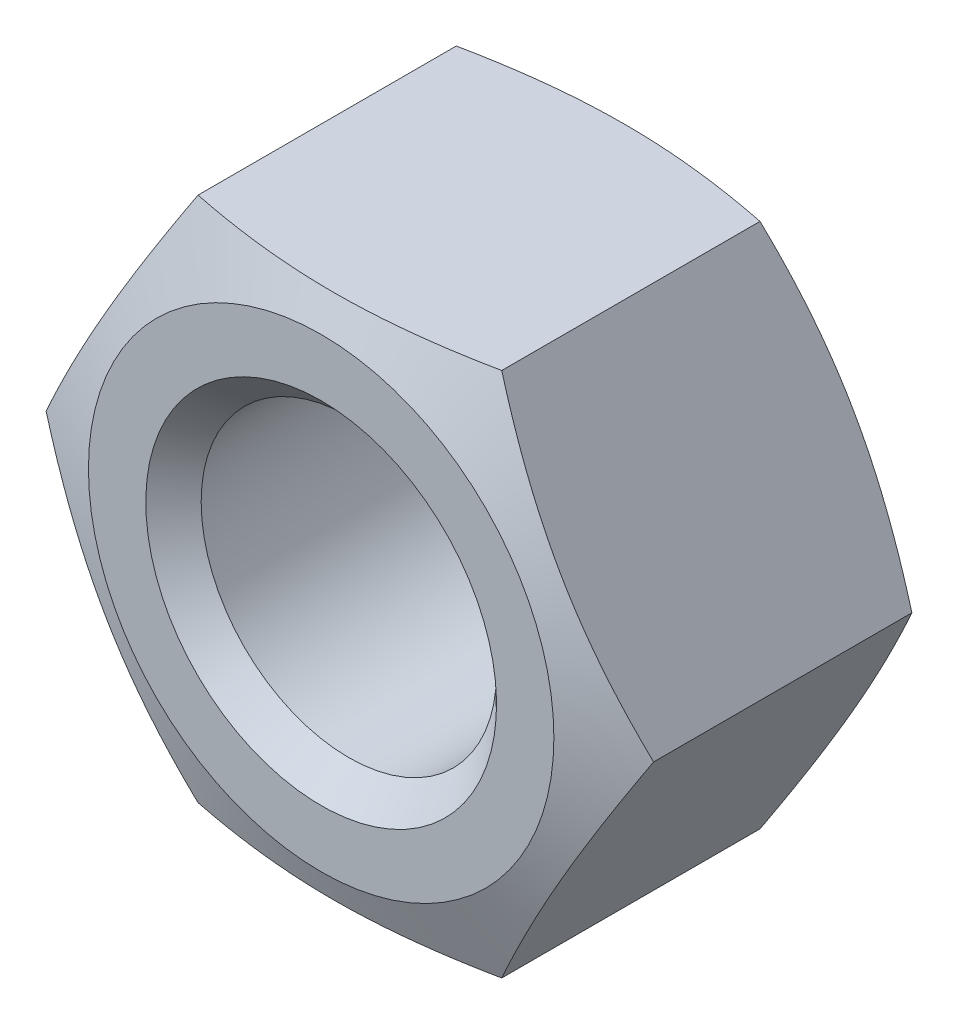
ISO-10303-21;
HEADER;
FILE_DESCRIPTION(('STEP AP214'),'2;1');
FILE_NAME('part.step','',(''),(''),'','','');
FILE_SCHEMA(('AUTOMOTIVE_DESIGN { 1 0 10303 214 1 1 1 1 }'));
ENDSEC;
DATA;
#1=APPLICATION_CONTEXT('core data for automotive mechanical design processes');
#2=APPLICATION_PROTOCOL_DEFINITION('international standard','automotive_design',2000,#1);
#3=PRODUCT_CONTEXT('',#1,'mechanical');
#4=PRODUCT('Part','Part','',(#3));
#5=PRODUCT_RELATED_PRODUCT_CATEGORY('part','',(#4));
#6=PRODUCT_DEFINITION_FORMATION('','',#4);
#7=PRODUCT_DEFINITION_CONTEXT('part definition',#1,'design');
#8=PRODUCT_DEFINITION('design','',#6,#7);
#9=PRODUCT_DEFINITION_SHAPE('','',#8);
#10=(LENGTH_UNIT() NAMED_UNIT(*) SI_UNIT(.MILLI.,.METRE.));
#11=(NAMED_UNIT(*) PLANE_ANGLE_UNIT() SI_UNIT($,.RADIAN.));
#12=(NAMED_UNIT(*) SI_UNIT($,.STERADIAN.) SOLID_ANGLE_UNIT());
#13=UNCERTAINTY_MEASURE_WITH_UNIT(LENGTH_MEASURE(1.E-05),#10,'distance_accuracy_value','');
#14=(GEOMETRIC_REPRESENTATION_CONTEXT(3) GLOBAL_UNCERTAINTY_ASSIGNED_CONTEXT((#13)) GLOBAL_UNIT_ASSIGNED_CONTEXT((#10,
#11,#12)) REPRESENTATION_CONTEXT('',''));
#15=CARTESIAN_POINT('',(0.,0.,0.));
#16=DIRECTION('',(0.,0.,1.));
#17=DIRECTION('',(1.,0.,0.));
#18=AXIS2_PLACEMENT_3D('',#15,#16,#17);
#19=CARTESIAN_POINT('',(10.3923,0.,10.8));
#20=DIRECTION('',(0.,0.,1.));
#21=DIRECTION('',(1.,0.,0.));
#22=AXIS2_PLACEMENT_3D('',#19,#20,#21);
#23=PLANE('',#22);
#24=CARTESIAN_POINT('',(0.,0.,10.8));
#25=DIRECTION('',(0.,0.,-1.));
#26=DIRECTION('',(0.,1.,0.));
#27=AXIS2_PLACEMENT_3D('',#24,#25,#26);
#28=CIRCLE('',#27,6.);
#29=CARTESIAN_POINT('',(0.,6.,10.8));
#30=VERTEX_POINT('',#29);
#31=EDGE_CURVE('E205',#30,#30,#28,.T.);
#32=ORIENTED_EDGE('',*,*,#31,.T.);
#33=EDGE_LOOP('',(#32));
#34=FACE_BOUND('',#33,.T.);
#35=CARTESIAN_POINT('',(0.,0.,10.8));
#36=DIRECTION('',(0.,0.,-1.));
#37=DIRECTION('',(0.,1.,0.));
#38=AXIS2_PLACEMENT_3D('',#35,#36,#37);
#39=CIRCLE('',#38,7.96221472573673);
#40=CARTESIAN_POINT('',(0.,7.96221472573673,10.8));
#41=VERTEX_POINT('',#40);
#42=EDGE_CURVE('E208',#41,#41,#39,.T.);
#43=ORIENTED_EDGE('',*,*,#42,.F.);
#44=EDGE_LOOP('',(#43));
#45=FACE_BOUND('',#44,.T.);
#46=ADVANCED_FACE('F14',(#34,#45),#23,.T.);
#47=CARTESIAN_POINT('',(0.,0.,10.8));
#48=DIRECTION('',(0.,0.,1.));
#49=DIRECTION('',(0.,-1.,0.));
#50=AXIS2_PLACEMENT_3D('',#47,#48,#49);
#51=CONICAL_SURFACE('',#50,6.,0.785398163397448);
#52=CARTESIAN_POINT('',(0.,0.,9.8528125));
#53=DIRECTION('',(0.,0.,-1.));
#54=DIRECTION('',(0.,1.,0.));
#55=AXIS2_PLACEMENT_3D('',#52,#53,#54);
#56=CIRCLE('',#55,5.0528125);
#57=CARTESIAN_POINT('',(0.,5.0528125,9.8528125));
#58=VERTEX_POINT('',#57);
#59=EDGE_CURVE('E95',#58,#58,#56,.T.);
#60=ORIENTED_EDGE('',*,*,#59,.T.);
#61=EDGE_LOOP('',(#60));
#62=FACE_BOUND('',#61,.T.);
#63=ORIENTED_EDGE('',*,*,#31,.F.);
#64=EDGE_LOOP('',(#63));
#65=FACE_BOUND('',#64,.T.);
#66=ADVANCED_FACE('F138',(#62,#65),#51,.F.);
#67=CARTESIAN_POINT('',(0.,0.,0.));
#68=DIRECTION('',(0.,0.,-1.));
#69=DIRECTION('',(0.,1.,0.));
#70=AXIS2_PLACEMENT_3D('',#67,#68,#69);
#71=CYLINDRICAL_SURFACE('',#70,5.0528125);
#72=CARTESIAN_POINT('',(0.,0.,0.9471875));
#73=DIRECTION('',(0.,0.,-1.));
#74=DIRECTION('',(0.,1.,0.));
#75=AXIS2_PLACEMENT_3D('',#72,#73,#74);
#76=CIRCLE('',#75,5.0528125);
#77=CARTESIAN_POINT('',(0.,5.0528125,0.9471875));
#78=VERTEX_POINT('',#77);
#79=EDGE_CURVE('E92',#78,#78,#76,.T.);
#80=ORIENTED_EDGE('',*,*,#79,.T.);
#81=EDGE_LOOP('',(#80));
#82=FACE_BOUND('',#81,.T.);
#83=ORIENTED_EDGE('',*,*,#59,.F.);
#84=EDGE_LOOP('',(#83));
#85=FACE_BOUND('',#84,.T.);
#86=ADVANCED_FACE('F200',(#82,#85),#71,.F.);
#87=CARTESIAN_POINT('',(0.,0.,0.));
#88=DIRECTION('',(0.,0.,-1.));
#89=DIRECTION('',(0.,1.,0.));
#90=AXIS2_PLACEMENT_3D('',#87,#88,#89);
#91=CONICAL_SURFACE('',#90,6.,0.785398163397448);
#92=ORIENTED_EDGE('',*,*,#79,.F.);
#93=EDGE_LOOP('',(#92));
#94=FACE_BOUND('',#93,.T.);
#95=CARTESIAN_POINT('',(0.,0.,0.));
#96=DIRECTION('',(0.,0.,-1.));
#97=DIRECTION('',(0.,1.,0.));
#98=AXIS2_PLACEMENT_3D('',#95,#96,#97);
#99=CIRCLE('',#98,6.);
#100=CARTESIAN_POINT('',(0.,6.,0.));
#101=VERTEX_POINT('',#100);
#102=EDGE_CURVE('E209',#101,#101,#99,.T.);
#103=ORIENTED_EDGE('',*,*,#102,.T.);
#104=EDGE_LOOP('',(#103));
#105=FACE_BOUND('',#104,.T.);
#106=ADVANCED_FACE('F136',(#94,#105),#91,.F.);
#107=CARTESIAN_POINT('',(0.,0.,9.81818181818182));
#108=DIRECTION('',(0.,0.,-1.));
#109=DIRECTION('',(0.,1.,0.));
#110=AXIS2_PLACEMENT_3D('',#107,#108,#109);
#111=CONICAL_SURFACE('',#110,10.3923,1.18682389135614);
#112=ORIENTED_EDGE('',*,*,#42,.T.);
#113=EDGE_LOOP('',(#112));
#114=FACE_BOUND('',#113,.T.);
#115=CARTESIAN_POINT('',(-13.7213175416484,-8.99999580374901,7.38704087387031));
#116=CARTESIAN_POINT('',(-13.3155095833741,-8.99999580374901,7.52409883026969));
#117=CARTESIAN_POINT('',(-12.9091608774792,-8.99999580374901,7.65958531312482));
#118=CARTESIAN_POINT('',(-12.0951022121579,-8.99999580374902,7.92653724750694));
#119=CARTESIAN_POINT('',(-11.6873921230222,-8.99999580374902,8.05800230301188));
#120=CARTESIAN_POINT('',(-10.8694196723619,-8.99999580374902,8.31631894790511));
#121=CARTESIAN_POINT('',(-10.4591535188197,-8.99999580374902,8.44315857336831));
#122=CARTESIAN_POINT('',(-9.63676583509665,-8.99999580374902,8.69066052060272));
#123=CARTESIAN_POINT('',(-9.22464435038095,-8.99999580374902,8.8113229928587));
#124=CARTESIAN_POINT('',(-8.40355167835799,-8.99999580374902,9.04340438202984));
#125=CARTESIAN_POINT('',(-7.9946087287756,-8.99999580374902,9.15492270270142));
#126=CARTESIAN_POINT('',(-7.17423324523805,-8.99999580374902,9.36851434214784));
#127=CARTESIAN_POINT('',(-6.76280063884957,-8.99999580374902,9.47058738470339));
#128=CARTESIAN_POINT('',(-5.93738971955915,-8.99999580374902,9.66284377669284));
#129=CARTESIAN_POINT('',(-5.52341298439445,-8.99999580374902,9.75303384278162));
#130=CARTESIAN_POINT('',(-4.69251804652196,-8.99999580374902,9.91873092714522));
#131=CARTESIAN_POINT('',(-4.27560005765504,-8.99999580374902,9.99423900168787));
#132=CARTESIAN_POINT('',(-3.52448503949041,-8.99999580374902,10.1137820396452));
#133=CARTESIAN_POINT('',(-3.19081245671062,-8.99999580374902,10.16109552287));
#134=CARTESIAN_POINT('',(-2.52188176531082,-8.99999580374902,10.2428488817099));
#135=CARTESIAN_POINT('',(-2.18662369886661,-8.99999580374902,10.2772890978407));
#136=CARTESIAN_POINT('',(-1.51515188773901,-8.99999580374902,10.3319321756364));
#137=CARTESIAN_POINT('',(-1.1789388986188,-8.99999580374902,10.3521442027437));
#138=CARTESIAN_POINT('',(-0.505939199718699,-8.99999580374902,10.3774838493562));
#139=CARTESIAN_POINT('',(-0.169152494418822,-8.99999580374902,10.3826115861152));
#140=CARTESIAN_POINT('',(0.505939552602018,-8.99999580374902,10.3775340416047));
#141=CARTESIAN_POINT('',(0.844244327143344,-8.99999580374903,10.3672541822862));
#142=CARTESIAN_POINT('',(1.5200587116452,-8.99999580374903,10.3316970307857));
#143=CARTESIAN_POINT('',(1.85756830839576,-8.99999580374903,10.3064194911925));
#144=CARTESIAN_POINT('',(2.5314533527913,-8.99999580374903,10.2419267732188));
#145=CARTESIAN_POINT('',(2.86782793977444,-8.99999580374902,10.2027027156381));
#146=CARTESIAN_POINT('',(3.53886726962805,-8.99999580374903,10.1117937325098));
#147=CARTESIAN_POINT('',(3.8735320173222,-8.99999580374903,10.0601088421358));
#148=CARTESIAN_POINT('',(4.59706326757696,-8.99999580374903,9.93631566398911));
#149=CARTESIAN_POINT('',(4.98559010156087,-8.99999580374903,9.8622350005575));
#150=CARTESIAN_POINT('',(5.76012811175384,-8.99999580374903,9.70183075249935));
#151=CARTESIAN_POINT('',(6.14613897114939,-8.99999580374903,9.61550565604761));
#152=CARTESIAN_POINT('',(6.91596603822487,-8.99999580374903,9.43283198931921));
#153=CARTESIAN_POINT('',(7.29978106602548,-8.99999580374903,9.33647848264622));
#154=CARTESIAN_POINT('',(8.06526157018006,-8.99999580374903,9.13568406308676));
#155=CARTESIAN_POINT('',(8.44692712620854,-8.99999580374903,9.03124345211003));
#156=CARTESIAN_POINT('',(9.20939547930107,-8.99999580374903,8.81552938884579));
#157=CARTESIAN_POINT('',(9.5901933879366,-8.99999580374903,8.70423873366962));
#158=CARTESIAN_POINT('',(10.3501827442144,-8.99999580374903,8.47631047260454));
#159=CARTESIAN_POINT('',(10.7293741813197,-8.99999580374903,8.35967283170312));
#160=CARTESIAN_POINT('',(11.4862787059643,-8.99999580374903,8.1220670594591));
#161=CARTESIAN_POINT('',(11.8639921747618,-8.99999580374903,8.00110013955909));
#162=CARTESIAN_POINT('',(12.618251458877,-8.99999580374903,7.75557437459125));
#163=CARTESIAN_POINT('',(12.9947972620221,-8.99999580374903,7.6310154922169));
#164=CARTESIAN_POINT('',(14.117808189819,-8.99999580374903,7.25463064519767));
#165=CARTESIAN_POINT('',(14.8628146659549,-8.99999580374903,6.99845398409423));
#166=CARTESIAN_POINT('',(16.3500116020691,-8.99999580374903,6.47792349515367));
#167=CARTESIAN_POINT('',(17.0922018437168,-8.99999580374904,6.21356904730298));
#168=CARTESIAN_POINT('',(18.5695432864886,-8.99999580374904,5.68069786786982));
#169=CARTESIAN_POINT('',(19.3047085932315,-8.99999580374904,5.41222018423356));
#170=CARTESIAN_POINT('',(20.4062006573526,-8.99999580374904,5.00624839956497));
#171=CARTESIAN_POINT('',(20.7731323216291,-8.99999580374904,4.87039057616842));
#172=CARTESIAN_POINT('',(21.5066380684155,-8.99999580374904,4.59771693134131));
#173=CARTESIAN_POINT('',(21.8732121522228,-8.99999580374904,4.46090111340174));
#174=CARTESIAN_POINT('',(22.2396315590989,-8.99999580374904,4.32367204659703));
#175=B_SPLINE_CURVE_WITH_KNOTS('',3,(#115,#116,#117,#118,#119,#120,#121,#122,#123,#124,#125,
#126,#127,#128,#129,#130,#131,#132,#133,#134,#135,#136,#137,#138,#139,#140,#141,#142,#143,#144,
#145,#146,#147,#148,#149,#150,#151,#152,#153,#154,#155,#156,#157,#158,#159,#160,#161,#162,#163,
#164,#165,#166,#167,#168,#169,#170,#171,#172,#173,#174),.UNSPECIFIED.,.F.,.F.,(4,2,2,2,2,2,2,2,
2,2,2,2,2,2,2,2,2,2,2,2,2,2,2,2,2,2,2,2,2,4),(0.,1.28499534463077,2.57011682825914,
3.85835550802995,5.14656278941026,6.41810144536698,7.6896772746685,8.96053125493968,
10.2312937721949,11.2421091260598,12.2528977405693,13.2630346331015,14.2731636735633,
15.288197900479,16.3032488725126,17.3189472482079,18.334642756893,19.5209748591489,
20.7074535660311,21.8945190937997,23.0815403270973,24.2716749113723,25.4618172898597,
26.6516292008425,27.8414534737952,30.2048363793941,32.568398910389,34.91634290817,
36.0901672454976,37.263987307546),.UNSPECIFIED.);
#176=CARTESIAN_POINT('',(-5.19615,-8.99999580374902,9.81818181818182));
#177=VERTEX_POINT('',#176);
#178=CARTESIAN_POINT('',(5.19615,-8.99999580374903,9.81818181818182));
#179=VERTEX_POINT('',#178);
#180=EDGE_CURVE('E75',#177,#179,#175,.T.);
#181=ORIENTED_EDGE('',*,*,#180,.T.);
#182=CARTESIAN_POINT('',(5.19614988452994,-8.99999600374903,9.81818177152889));
#183=CARTESIAN_POINT('',(5.37768933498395,-8.68556045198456,9.89153268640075));
#184=CARTESIAN_POINT('',(5.55982797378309,-8.37008707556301,9.9593574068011));
#185=CARTESIAN_POINT('',(5.92530962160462,-7.73705429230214,10.0818698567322));
#186=CARTESIAN_POINT('',(6.10865327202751,-7.41949377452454,10.136549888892));
#187=CARTESIAN_POINT('',(6.47628397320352,-6.78273872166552,10.2305837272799));
#188=CARTESIAN_POINT('',(6.66057072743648,-6.46354470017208,10.2699420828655));
#189=CARTESIAN_POINT('',(7.02982878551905,-5.82397098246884,10.3315086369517));
#190=CARTESIAN_POINT('',(7.21479992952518,-5.50359156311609,10.3537206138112));
#191=CARTESIAN_POINT('',(7.58192629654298,-4.86771004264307,10.3796131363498));
#192=CARTESIAN_POINT('',(7.76407600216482,-4.55221749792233,10.3836019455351));
#193=CARTESIAN_POINT('',(8.12826777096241,-3.92141885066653,10.3736718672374));
#194=CARTESIAN_POINT('',(8.31030982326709,-3.60611276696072,10.3597514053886));
#195=CARTESIAN_POINT('',(8.6737364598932,-2.97663936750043,10.3147511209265));
#196=CARTESIAN_POINT('',(8.85512138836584,-2.66247145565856,10.2836822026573));
#197=CARTESIAN_POINT('',(9.21702522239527,-2.03563562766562,10.2058906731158));
#198=CARTESIAN_POINT('',(9.39754421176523,-1.72296756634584,10.1591696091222));
#199=CARTESIAN_POINT('',(9.64562758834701,-1.29327455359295,10.0853171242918));
#200=CARTESIAN_POINT('',(9.71364398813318,-1.17546669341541,10.064064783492));
#201=CARTESIAN_POINT('',(9.8495162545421,-0.940129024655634,10.0197094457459));
#202=CARTESIAN_POINT('',(9.91737214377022,-0.822599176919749,9.99660672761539));
#203=CARTESIAN_POINT('',(10.053161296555,-0.587405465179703,9.94857527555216));
#204=CARTESIAN_POINT('',(10.1210940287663,-0.469742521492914,9.92364055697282));
#205=CARTESIAN_POINT('',(10.2568106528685,-0.234674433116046,9.87212109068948));
#206=CARTESIAN_POINT('',(10.324594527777,-0.117269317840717,9.84553616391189));
#207=CARTESIAN_POINT('',(10.39230011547,1.99999999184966E-07,9.81818177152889));
#208=B_SPLINE_CURVE_WITH_KNOTS('',3,(#182,#183,#184,#185,#186,#187,#188,#189,#190,#191,#192,
#193,#194,#195,#196,#197,#198,#199,#200,#201,#202,#203,#204,#205,#206,#207),.UNSPECIFIED.,.F.,
.F.,(4,2,2,2,2,2,2,2,2,2,2,2,4),(0.,1.1113202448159,2.22328968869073,3.33492871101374,
4.44632270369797,5.53884497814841,6.63146330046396,7.7233876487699,8.81520408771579,
9.22824501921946,9.64122383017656,10.0556174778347,10.4700561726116),.UNSPECIFIED.);
#209=CARTESIAN_POINT('',(10.3923,0.,9.81818181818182));
#210=VERTEX_POINT('',#209);
#211=EDGE_CURVE('E160',#179,#210,#208,.T.);
#212=ORIENTED_EDGE('',*,*,#211,.T.);
#213=CARTESIAN_POINT('',(10.39230011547,-1.99999999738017E-07,9.81818177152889));
#214=CARTESIAN_POINT('',(10.210760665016,0.314435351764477,9.89153268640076));
#215=CARTESIAN_POINT('',(10.0286220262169,0.629908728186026,9.9593574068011));
#216=CARTESIAN_POINT('',(9.66314037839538,1.2629415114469,10.0818698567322));
#217=CARTESIAN_POINT('',(9.47979672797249,1.5805020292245,10.136549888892));
#218=CARTESIAN_POINT('',(9.11216602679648,2.21725708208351,10.2305837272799));
#219=CARTESIAN_POINT('',(8.92787927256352,2.53645110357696,10.2699420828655));
#220=CARTESIAN_POINT('',(8.55862121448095,3.1760248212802,10.3315086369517));
#221=CARTESIAN_POINT('',(8.37365007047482,3.49640424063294,10.3537206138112));
#222=CARTESIAN_POINT('',(8.00652370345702,4.13228576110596,10.3796131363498));
#223=CARTESIAN_POINT('',(7.82437399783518,4.4477783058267,10.3836019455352));
#224=CARTESIAN_POINT('',(7.46018222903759,5.0785769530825,10.3736718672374));
#225=CARTESIAN_POINT('',(7.27814017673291,5.39388303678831,10.3597514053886));
#226=CARTESIAN_POINT('',(6.91471354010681,6.0233564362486,10.3147511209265));
#227=CARTESIAN_POINT('',(6.73332861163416,6.33752434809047,10.2836822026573));
#228=CARTESIAN_POINT('',(6.37142477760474,6.96436017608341,10.2058906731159));
#229=CARTESIAN_POINT('',(6.19090578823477,7.27702823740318,10.1591696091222));
#230=CARTESIAN_POINT('',(5.94282241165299,7.70672125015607,10.0853171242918));
#231=CARTESIAN_POINT('',(5.87480601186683,7.82452911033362,10.064064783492));
#232=CARTESIAN_POINT('',(5.73893374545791,8.05986677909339,10.0197094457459));
#233=CARTESIAN_POINT('',(5.67107785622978,8.17739662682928,9.99660672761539));
#234=CARTESIAN_POINT('',(5.53528870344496,8.41259033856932,9.94857527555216));
#235=CARTESIAN_POINT('',(5.46735597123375,8.53025328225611,9.92364055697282));
#236=CARTESIAN_POINT('',(5.33163934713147,8.76532137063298,9.87212109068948));
#237=CARTESIAN_POINT('',(5.26385547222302,8.88272648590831,9.84553616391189));
#238=CARTESIAN_POINT('',(5.19614988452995,8.99999600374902,9.81818177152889));
#239=B_SPLINE_CURVE_WITH_KNOTS('',3,(#213,#214,#215,#216,#217,#218,#219,#220,#221,#222,#223,
#224,#225,#226,#227,#228,#229,#230,#231,#232,#233,#234,#235,#236,#237,#238),.UNSPECIFIED.,.F.,
.F.,(4,2,2,2,2,2,2,2,2,2,2,2,4),(0.,1.1113202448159,2.22328968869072,3.33492871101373,
4.44632270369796,5.5388449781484,6.63146330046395,7.72338764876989,8.81520408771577,
9.22824501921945,9.64122383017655,10.0556174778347,10.4700561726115),.UNSPECIFIED.);
#240=CARTESIAN_POINT('',(5.19615,8.99999580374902,9.81818181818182));
#241=VERTEX_POINT('',#240);
#242=EDGE_CURVE('E37',#210,#241,#239,.T.);
#243=ORIENTED_EDGE('',*,*,#242,.T.);
#244=CARTESIAN_POINT('',(-13.7213175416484,8.99999580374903,7.38704087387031));
#245=CARTESIAN_POINT('',(-13.3155095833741,8.99999580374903,7.52409883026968));
#246=CARTESIAN_POINT('',(-12.9091608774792,8.99999580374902,7.65958531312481));
#247=CARTESIAN_POINT('',(-12.0951022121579,8.99999580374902,7.92653724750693));
#248=CARTESIAN_POINT('',(-11.6873921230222,8.99999580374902,8.05800230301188));
#249=CARTESIAN_POINT('',(-10.8694196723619,8.99999580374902,8.31631894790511));
#250=CARTESIAN_POINT('',(-10.4591535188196,8.99999580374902,8.44315857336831));
#251=CARTESIAN_POINT('',(-9.63676583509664,8.99999580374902,8.69066052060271));
#252=CARTESIAN_POINT('',(-9.22464435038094,8.99999580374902,8.8113229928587));
#253=CARTESIAN_POINT('',(-8.40355167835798,8.99999580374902,9.04340438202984));
#254=CARTESIAN_POINT('',(-7.9946087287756,8.99999580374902,9.15492270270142));
#255=CARTESIAN_POINT('',(-7.17423324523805,8.99999580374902,9.36851434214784));
#256=CARTESIAN_POINT('',(-6.76280063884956,8.99999580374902,9.47058738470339));
#257=CARTESIAN_POINT('',(-5.93738971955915,8.99999580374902,9.66284377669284));
#258=CARTESIAN_POINT('',(-5.52341298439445,8.99999580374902,9.75303384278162));
#259=CARTESIAN_POINT('',(-4.69251804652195,8.99999580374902,9.91873092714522));
#260=CARTESIAN_POINT('',(-4.27560005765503,8.99999580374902,9.99423900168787));
#261=CARTESIAN_POINT('',(-3.5244850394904,8.99999580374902,10.1137820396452));
#262=CARTESIAN_POINT('',(-3.19081245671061,8.99999580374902,10.16109552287));
#263=CARTESIAN_POINT('',(-2.52188176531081,8.99999580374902,10.2428488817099));
#264=CARTESIAN_POINT('',(-2.1866236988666,8.99999580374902,10.2772890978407));
#265=CARTESIAN_POINT('',(-1.515151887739,8.99999580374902,10.3319321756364));
#266=CARTESIAN_POINT('',(-1.17893889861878,8.99999580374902,10.3521442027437));
#267=CARTESIAN_POINT('',(-0.505939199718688,8.99999580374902,10.3774838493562));
#268=CARTESIAN_POINT('',(-0.169152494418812,8.99999580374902,10.3826115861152));
#269=CARTESIAN_POINT('',(0.505939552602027,8.99999580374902,10.3775340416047));
#270=CARTESIAN_POINT('',(0.844244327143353,8.99999580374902,10.3672541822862));
#271=CARTESIAN_POINT('',(1.52005871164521,8.99999580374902,10.3316970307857));
#272=CARTESIAN_POINT('',(1.85756830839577,8.99999580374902,10.3064194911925));
#273=CARTESIAN_POINT('',(2.5314533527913,8.99999580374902,10.2419267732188));
#274=CARTESIAN_POINT('',(2.86782793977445,8.99999580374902,10.2027027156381));
#275=CARTESIAN_POINT('',(3.53886726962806,8.99999580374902,10.1117937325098));
#276=CARTESIAN_POINT('',(3.87353201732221,8.99999580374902,10.0601088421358));
#277=CARTESIAN_POINT('',(4.59706326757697,8.99999580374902,9.93631566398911));
#278=CARTESIAN_POINT('',(4.98559010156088,8.99999580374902,9.8622350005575));
#279=CARTESIAN_POINT('',(5.76012811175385,8.99999580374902,9.70183075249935));
#280=CARTESIAN_POINT('',(6.1461389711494,8.99999580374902,9.61550565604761));
#281=CARTESIAN_POINT('',(6.91596603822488,8.99999580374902,9.43283198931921));
#282=CARTESIAN_POINT('',(7.29978106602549,8.99999580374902,9.33647848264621));
#283=CARTESIAN_POINT('',(8.06526157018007,8.99999580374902,9.13568406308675));
#284=CARTESIAN_POINT('',(8.44692712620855,8.99999580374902,9.03124345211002));
#285=CARTESIAN_POINT('',(9.20939547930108,8.99999580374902,8.81552938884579));
#286=CARTESIAN_POINT('',(9.59019338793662,8.99999580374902,8.70423873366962));
#287=CARTESIAN_POINT('',(10.3501827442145,8.99999580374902,8.47631047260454));
#288=CARTESIAN_POINT('',(10.7293741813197,8.99999580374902,8.35967283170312));
#289=CARTESIAN_POINT('',(11.4862787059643,8.99999580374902,8.1220670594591));
#290=CARTESIAN_POINT('',(11.8639921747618,8.99999580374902,8.00110013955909));
#291=CARTESIAN_POINT('',(12.618251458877,8.99999580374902,7.75557437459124));
#292=CARTESIAN_POINT('',(12.9947972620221,8.99999580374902,7.63101549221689));
#293=CARTESIAN_POINT('',(14.117808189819,8.99999580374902,7.25463064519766));
#294=CARTESIAN_POINT('',(14.8628146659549,8.99999580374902,6.99845398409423));
#295=CARTESIAN_POINT('',(16.3500116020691,8.99999580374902,6.47792349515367));
#296=CARTESIAN_POINT('',(17.0922018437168,8.99999580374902,6.21356904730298));
#297=CARTESIAN_POINT('',(18.5695432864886,8.99999580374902,5.68069786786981));
#298=CARTESIAN_POINT('',(19.3047085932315,8.99999580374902,5.41222018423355));
#299=CARTESIAN_POINT('',(20.4062006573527,8.99999580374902,5.00624839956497));
#300=CARTESIAN_POINT('',(20.7731323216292,8.99999580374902,4.87039057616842));
#301=CARTESIAN_POINT('',(21.5066380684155,8.99999580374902,4.5977169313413));
#302=CARTESIAN_POINT('',(21.8732121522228,8.99999580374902,4.46090111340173));
#303=CARTESIAN_POINT('',(22.2396315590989,8.99999580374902,4.32367204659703));
#304=B_SPLINE_CURVE_WITH_KNOTS('',3,(#244,#245,#246,#247,#248,#249,#250,#251,#252,#253,#254,
#255,#256,#257,#258,#259,#260,#261,#262,#263,#264,#265,#266,#267,#268,#269,#270,#271,#272,#273,
#274,#275,#276,#277,#278,#279,#280,#281,#282,#283,#284,#285,#286,#287,#288,#289,#290,#291,#292,
#293,#294,#295,#296,#297,#298,#299,#300,#301,#302,#303),.UNSPECIFIED.,.F.,.F.,(4,2,2,2,2,2,2,2,
2,2,2,2,2,2,2,2,2,2,2,2,2,2,2,2,2,2,2,2,2,4),(0.,1.28499534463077,2.57011682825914,
3.85835550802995,5.14656278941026,6.41810144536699,7.6896772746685,8.96053125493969,
10.2312937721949,11.2421091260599,12.2528977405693,13.2630346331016,14.2731636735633,
15.288197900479,16.3032488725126,17.3189472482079,18.334642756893,19.5209748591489,
20.7074535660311,21.8945190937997,23.0815403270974,24.2716749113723,25.4618172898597,
26.6516292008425,27.8414534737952,30.2048363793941,32.568398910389,34.91634290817,
36.0901672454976,37.263987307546),.UNSPECIFIED.);
#305=CARTESIAN_POINT('',(-5.19615,8.99999580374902,9.81818181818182));
#306=VERTEX_POINT('',#305);
#307=EDGE_CURVE('E151',#241,#306,#304,.F.);
#308=ORIENTED_EDGE('',*,*,#307,.T.);
#309=CARTESIAN_POINT('',(-5.19614988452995,8.99999600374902,9.81818177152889));
#310=CARTESIAN_POINT('',(-5.37768933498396,8.68556045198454,9.89153268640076));
#311=CARTESIAN_POINT('',(-5.5598279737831,8.370087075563,9.9593574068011));
#312=CARTESIAN_POINT('',(-5.92530962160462,7.73705429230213,10.0818698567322));
#313=CARTESIAN_POINT('',(-6.10865327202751,7.41949377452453,10.136549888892));
#314=CARTESIAN_POINT('',(-6.47628397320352,6.78273872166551,10.2305837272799));
#315=CARTESIAN_POINT('',(-6.66057072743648,6.46354470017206,10.2699420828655));
#316=CARTESIAN_POINT('',(-7.02982878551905,5.82397098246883,10.3315086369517));
#317=CARTESIAN_POINT('',(-7.21479992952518,5.50359156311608,10.3537206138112));
#318=CARTESIAN_POINT('',(-7.58192629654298,4.86771004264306,10.3796131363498));
#319=CARTESIAN_POINT('',(-7.76407600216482,4.55221749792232,10.3836019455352));
#320=CARTESIAN_POINT('',(-8.12826777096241,3.92141885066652,10.3736718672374));
#321=CARTESIAN_POINT('',(-8.31030982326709,3.60611276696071,10.3597514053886));
#322=CARTESIAN_POINT('',(-8.67373645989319,2.97663936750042,10.3147511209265));
#323=CARTESIAN_POINT('',(-8.85512138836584,2.66247145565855,10.2836822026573));
#324=CARTESIAN_POINT('',(-9.21702522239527,2.03563562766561,10.2058906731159));
#325=CARTESIAN_POINT('',(-9.39754421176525,1.72296756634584,10.1591696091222));
#326=CARTESIAN_POINT('',(-9.64562758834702,1.29327455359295,10.0853171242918));
#327=CARTESIAN_POINT('',(-9.71364398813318,1.1754666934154,10.064064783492));
#328=CARTESIAN_POINT('',(-9.84951625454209,0.940129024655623,10.0197094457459));
#329=CARTESIAN_POINT('',(-9.91737214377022,0.822599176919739,9.99660672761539));
#330=CARTESIAN_POINT('',(-10.053161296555,0.587405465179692,9.94857527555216));
#331=CARTESIAN_POINT('',(-10.1210940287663,0.469742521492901,9.92364055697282));
#332=CARTESIAN_POINT('',(-10.2568106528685,0.234674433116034,9.87212109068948));
#333=CARTESIAN_POINT('',(-10.324594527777,0.117269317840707,9.84553616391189));
#334=CARTESIAN_POINT('',(-10.3923001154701,-2.00000000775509E-07,9.81818177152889));
#335=B_SPLINE_CURVE_WITH_KNOTS('',3,(#309,#310,#311,#312,#313,#314,#315,#316,#317,#318,#319,
#320,#321,#322,#323,#324,#325,#326,#327,#328,#329,#330,#331,#332,#333,#334),.UNSPECIFIED.,.F.,
.F.,(4,2,2,2,2,2,2,2,2,2,2,2,4),(0.,1.1113202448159,2.22328968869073,3.33492871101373,
4.44632270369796,5.5388449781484,6.63146330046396,7.7233876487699,8.81520408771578,
9.22824501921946,9.64122383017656,10.0556174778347,10.4700561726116),.UNSPECIFIED.);
#336=CARTESIAN_POINT('',(-10.3923,0.,9.81818181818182));
#337=VERTEX_POINT('',#336);
#338=EDGE_CURVE('E146',#306,#337,#335,.T.);
#339=ORIENTED_EDGE('',*,*,#338,.T.);
#340=CARTESIAN_POINT('',(-10.39230011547,1.9999999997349E-07,9.81818177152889));
#341=CARTESIAN_POINT('',(-10.210760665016,-0.314435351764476,9.89153268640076));
#342=CARTESIAN_POINT('',(-10.0286220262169,-0.629908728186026,9.9593574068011));
#343=CARTESIAN_POINT('',(-9.66314037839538,-1.2629415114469,10.0818698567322));
#344=CARTESIAN_POINT('',(-9.47979672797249,-1.5805020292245,10.136549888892));
#345=CARTESIAN_POINT('',(-9.11216602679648,-2.21725708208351,10.2305837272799));
#346=CARTESIAN_POINT('',(-8.92787927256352,-2.53645110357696,10.2699420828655));
#347=CARTESIAN_POINT('',(-8.55862121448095,-3.17602482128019,10.3315086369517));
#348=CARTESIAN_POINT('',(-8.37365007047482,-3.49640424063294,10.3537206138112));
#349=CARTESIAN_POINT('',(-8.00652370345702,-4.13228576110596,10.3796131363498));
#350=CARTESIAN_POINT('',(-7.82437399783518,-4.4477783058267,10.3836019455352));
#351=CARTESIAN_POINT('',(-7.46018222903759,-5.0785769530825,10.3736718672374));
#352=CARTESIAN_POINT('',(-7.27814017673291,-5.39388303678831,10.3597514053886));
#353=CARTESIAN_POINT('',(-6.91471354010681,-6.0233564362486,10.3147511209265));
#354=CARTESIAN_POINT('',(-6.73332861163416,-6.33752434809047,10.2836822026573));
#355=CARTESIAN_POINT('',(-6.37142477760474,-6.96436017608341,10.2058906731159));
#356=CARTESIAN_POINT('',(-6.19090578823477,-7.27702823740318,10.1591696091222));
#357=CARTESIAN_POINT('',(-5.94282241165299,-7.70672125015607,10.0853171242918));
#358=CARTESIAN_POINT('',(-5.87480601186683,-7.82452911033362,10.064064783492));
#359=CARTESIAN_POINT('',(-5.73893374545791,-8.05986677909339,10.0197094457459));
#360=CARTESIAN_POINT('',(-5.67107785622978,-8.17739662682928,9.99660672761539));
#361=CARTESIAN_POINT('',(-5.53528870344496,-8.41259033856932,9.94857527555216));
#362=CARTESIAN_POINT('',(-5.46735597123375,-8.53025328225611,9.92364055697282));
#363=CARTESIAN_POINT('',(-5.33163934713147,-8.76532137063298,9.87212109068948));
#364=CARTESIAN_POINT('',(-5.26385547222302,-8.88272648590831,9.84553616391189));
#365=CARTESIAN_POINT('',(-5.19614988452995,-8.99999600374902,9.81818177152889));
#366=B_SPLINE_CURVE_WITH_KNOTS('',3,(#340,#341,#342,#343,#344,#345,#346,#347,#348,#349,#350,
#351,#352,#353,#354,#355,#356,#357,#358,#359,#360,#361,#362,#363,#364,#365),.UNSPECIFIED.,.F.,
.F.,(4,2,2,2,2,2,2,2,2,2,2,2,4),(0.,1.1113202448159,2.22328968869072,3.33492871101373,
4.44632270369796,5.5388449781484,6.63146330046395,7.72338764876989,8.81520408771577,
9.22824501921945,9.64122383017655,10.0556174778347,10.4700561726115),.UNSPECIFIED.);
#367=EDGE_CURVE('E123',#337,#177,#366,.T.);
#368=ORIENTED_EDGE('',*,*,#367,.T.);
#369=EDGE_LOOP('',(#181,#212,#243,#308,#339,#368));
#370=FACE_BOUND('',#369,.T.);
#371=ADVANCED_FACE('F132',(#114,#370),#111,.T.);
#372=CARTESIAN_POINT('',(5.19615,-8.99999580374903,10.8));
#373=DIRECTION('',(-0.866025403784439,0.5,0.));
#374=DIRECTION('',(-0.5,-0.866025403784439,0.));
#375=AXIS2_PLACEMENT_3D('',#372,#373,#374);
#376=PLANE('',#375);
#377=ORIENTED_EDGE('',*,*,#211,.F.);
#378=DIRECTION('',(0.,0.,-1.));
#379=VECTOR('',#378,1.);
#380=CARTESIAN_POINT('',(5.19615,-8.99999580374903,10.8));
#381=LINE('',#380,#379);
#382=CARTESIAN_POINT('',(5.19615,-8.99999580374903,0.981818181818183));
#383=VERTEX_POINT('',#382);
#384=EDGE_CURVE('E79',#179,#383,#381,.T.);
#385=ORIENTED_EDGE('',*,*,#384,.T.);
#386=CARTESIAN_POINT('',(10.3923001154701,2.E-07,0.981818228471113));
#387=CARTESIAN_POINT('',(10.2107606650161,-0.31443535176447,0.908467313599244));
#388=CARTESIAN_POINT('',(10.0286220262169,-0.629908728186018,0.840642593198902));
#389=CARTESIAN_POINT('',(9.66314037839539,-1.26294151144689,0.718130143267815));
#390=CARTESIAN_POINT('',(9.4797967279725,-1.58050202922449,0.663450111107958));
#391=CARTESIAN_POINT('',(9.11216602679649,-2.21725708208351,0.569416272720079));
#392=CARTESIAN_POINT('',(8.92787927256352,-2.53645110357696,0.530057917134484));
#393=CARTESIAN_POINT('',(8.55862121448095,-3.1760248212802,0.468491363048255));
#394=CARTESIAN_POINT('',(8.37365007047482,-3.49640424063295,0.446279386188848));
#395=CARTESIAN_POINT('',(8.00652370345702,-4.13228576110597,0.420386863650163));
#396=CARTESIAN_POINT('',(7.82437399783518,-4.44777830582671,0.416398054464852));
#397=CARTESIAN_POINT('',(7.46018222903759,-5.07857695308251,0.426328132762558));
#398=CARTESIAN_POINT('',(7.27814017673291,-5.39388303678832,0.440248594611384));
#399=CARTESIAN_POINT('',(6.91471354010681,-6.02335643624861,0.485248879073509));
#400=CARTESIAN_POINT('',(6.73332861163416,-6.33752434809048,0.51631779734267));
#401=CARTESIAN_POINT('',(6.37142477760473,-6.96436017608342,0.594109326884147));
#402=CARTESIAN_POINT('',(6.19090578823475,-7.27702823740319,0.640830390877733));
#403=CARTESIAN_POINT('',(5.94282241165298,-7.70672125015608,0.71468287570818));
#404=CARTESIAN_POINT('',(5.87480601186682,-7.82452911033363,0.735935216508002));
#405=CARTESIAN_POINT('',(5.73893374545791,-8.0598667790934,0.780290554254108));
#406=CARTESIAN_POINT('',(5.67107785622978,-8.17739662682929,0.803393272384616));
#407=CARTESIAN_POINT('',(5.53528870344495,-8.41259033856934,0.851424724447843));
#408=CARTESIAN_POINT('',(5.46735597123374,-8.53025328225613,0.876359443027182));
#409=CARTESIAN_POINT('',(5.33163934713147,-8.76532137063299,0.927878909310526));
#410=CARTESIAN_POINT('',(5.26385547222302,-8.88272648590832,0.954463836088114));
#411=CARTESIAN_POINT('',(5.19614988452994,-8.99999600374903,0.981818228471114));
#412=B_SPLINE_CURVE_WITH_KNOTS('',3,(#386,#387,#388,#389,#390,#391,#392,#393,#394,#395,#396,
#397,#398,#399,#400,#401,#402,#403,#404,#405,#406,#407,#408,#409,#410,#411),.UNSPECIFIED.,.F.,
.F.,(4,2,2,2,2,2,2,2,2,2,2,2,4),(0.,1.1113202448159,2.22328968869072,3.33492871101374,
4.44632270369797,5.53884497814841,6.63146330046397,7.72338764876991,8.81520408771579,
9.22824501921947,9.64122383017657,10.0556174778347,10.4700561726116),.UNSPECIFIED.);
#413=CARTESIAN_POINT('',(10.3923,0.,0.981818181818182));
#414=VERTEX_POINT('',#413);
#415=EDGE_CURVE('E30',#414,#383,#412,.T.);
#416=ORIENTED_EDGE('',*,*,#415,.F.);
#417=DIRECTION('',(0.,0.,-1.));
#418=VECTOR('',#417,1.);
#419=CARTESIAN_POINT('',(10.3923,0.,10.8));
#420=LINE('',#419,#418);
#421=EDGE_CURVE('E23',#210,#414,#420,.T.);
#422=ORIENTED_EDGE('',*,*,#421,.F.);
#423=EDGE_LOOP('',(#377,#385,#416,#422));
#424=FACE_BOUND('',#423,.T.);
#425=ADVANCED_FACE('F16',(#424),#376,.F.);
#426=CARTESIAN_POINT('',(10.3923,0.,10.8));
#427=DIRECTION('',(-0.866025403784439,-0.5,0.));
#428=DIRECTION('',(0.5,-0.866025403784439,0.));
#429=AXIS2_PLACEMENT_3D('',#426,#427,#428);
#430=PLANE('',#429);
#431=ORIENTED_EDGE('',*,*,#242,.F.);
#432=ORIENTED_EDGE('',*,*,#421,.T.);
#433=CARTESIAN_POINT('',(5.19614988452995,8.99999600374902,0.981818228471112));
#434=CARTESIAN_POINT('',(5.37768933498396,8.68556045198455,0.908467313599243));
#435=CARTESIAN_POINT('',(5.5598279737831,8.370087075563,0.8406425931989));
#436=CARTESIAN_POINT('',(5.92530962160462,7.73705429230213,0.718130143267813));
#437=CARTESIAN_POINT('',(6.10865327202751,7.41949377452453,0.663450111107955));
#438=CARTESIAN_POINT('',(6.47628397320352,6.78273872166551,0.569416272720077));
#439=CARTESIAN_POINT('',(6.66057072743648,6.46354470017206,0.530057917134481));
#440=CARTESIAN_POINT('',(7.02982878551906,5.82397098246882,0.468491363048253));
#441=CARTESIAN_POINT('',(7.21479992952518,5.50359156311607,0.446279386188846));
#442=CARTESIAN_POINT('',(7.58192629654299,4.86771004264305,0.420386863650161));
#443=CARTESIAN_POINT('',(7.76407600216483,4.55221749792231,0.41639805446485));
#444=CARTESIAN_POINT('',(8.12826777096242,3.92141885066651,0.426328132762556));
#445=CARTESIAN_POINT('',(8.3103098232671,3.6061127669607,0.440248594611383));
#446=CARTESIAN_POINT('',(8.6737364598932,2.97663936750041,0.485248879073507));
#447=CARTESIAN_POINT('',(8.85512138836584,2.66247145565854,0.516317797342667));
#448=CARTESIAN_POINT('',(9.21702522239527,2.03563562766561,0.594109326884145));
#449=CARTESIAN_POINT('',(9.39754421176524,1.72296756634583,0.640830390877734));
#450=CARTESIAN_POINT('',(9.64562758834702,1.29327455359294,0.71468287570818));
#451=CARTESIAN_POINT('',(9.71364398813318,1.1754666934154,0.735935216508));
#452=CARTESIAN_POINT('',(9.8495162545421,0.940129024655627,0.780290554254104));
#453=CARTESIAN_POINT('',(9.91737214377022,0.822599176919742,0.803393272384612));
#454=CARTESIAN_POINT('',(10.053161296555,0.587405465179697,0.851424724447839));
#455=CARTESIAN_POINT('',(10.1210940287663,0.469742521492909,0.876359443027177));
#456=CARTESIAN_POINT('',(10.2568106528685,0.234674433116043,0.927878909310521));
#457=CARTESIAN_POINT('',(10.324594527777,0.117269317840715,0.95446383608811));
#458=CARTESIAN_POINT('',(10.39230011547,-1.99999999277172E-07,0.981818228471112));
#459=B_SPLINE_CURVE_WITH_KNOTS('',3,(#433,#434,#435,#436,#437,#438,#439,#440,#441,#442,#443,
#444,#445,#446,#447,#448,#449,#450,#451,#452,#453,#454,#455,#456,#457,#458),.UNSPECIFIED.,.F.,
.F.,(4,2,2,2,2,2,2,2,2,2,2,2,4),(0.,1.1113202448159,2.22328968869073,3.33492871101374,
4.44632270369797,5.53884497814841,6.63146330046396,7.7233876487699,8.81520408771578,
9.22824501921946,9.64122383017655,10.0556174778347,10.4700561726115),.UNSPECIFIED.);
#460=CARTESIAN_POINT('',(5.19615,8.99999580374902,0.981818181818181));
#461=VERTEX_POINT('',#460);
#462=EDGE_CURVE('E171',#461,#414,#459,.T.);
#463=ORIENTED_EDGE('',*,*,#462,.F.);
#464=DIRECTION('',(0.,0.,-1.));
#465=VECTOR('',#464,1.);
#466=CARTESIAN_POINT('',(5.19615,8.99999580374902,10.8));
#467=LINE('',#466,#465);
#468=EDGE_CURVE('E385',#241,#461,#467,.T.);
#469=ORIENTED_EDGE('',*,*,#468,.F.);
#470=EDGE_LOOP('',(#431,#432,#463,#469));
#471=FACE_BOUND('',#470,.T.);
#472=ADVANCED_FACE('F165',(#471),#430,.F.);
#473=CARTESIAN_POINT('',(5.19615,8.99999580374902,10.8));
#474=DIRECTION('',(0.,-1.,0.));
#475=DIRECTION('',(1.,0.,0.));
#476=AXIS2_PLACEMENT_3D('',#473,#474,#475);
#477=PLANE('',#476);
#478=ORIENTED_EDGE('',*,*,#307,.F.);
#479=ORIENTED_EDGE('',*,*,#468,.T.);
#480=CARTESIAN_POINT('',(-13.7213175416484,8.99999580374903,3.41295912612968));
#481=CARTESIAN_POINT('',(-13.3155095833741,8.99999580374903,3.27590116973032));
#482=CARTESIAN_POINT('',(-12.9091608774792,8.99999580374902,3.14041468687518));
#483=CARTESIAN_POINT('',(-12.0951022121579,8.99999580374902,2.87346275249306));
#484=CARTESIAN_POINT('',(-11.6873921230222,8.99999580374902,2.74199769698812));
#485=CARTESIAN_POINT('',(-10.8694196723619,8.99999580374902,2.48368105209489));
#486=CARTESIAN_POINT('',(-10.4591535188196,8.99999580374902,2.35684142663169));
#487=CARTESIAN_POINT('',(-9.63676583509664,8.99999580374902,2.10933947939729));
#488=CARTESIAN_POINT('',(-9.22464435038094,8.99999580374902,1.9886770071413));
#489=CARTESIAN_POINT('',(-8.40355167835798,8.99999580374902,1.75659561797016));
#490=CARTESIAN_POINT('',(-7.9946087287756,8.99999580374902,1.64507729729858));
#491=CARTESIAN_POINT('',(-7.17423324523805,8.99999580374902,1.43148565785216));
#492=CARTESIAN_POINT('',(-6.76280063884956,8.99999580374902,1.32941261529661));
#493=CARTESIAN_POINT('',(-5.93738971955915,8.99999580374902,1.13715622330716));
#494=CARTESIAN_POINT('',(-5.52341298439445,8.99999580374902,1.04696615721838));
#495=CARTESIAN_POINT('',(-4.69251804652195,8.99999580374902,0.881269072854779));
#496=CARTESIAN_POINT('',(-4.27560005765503,8.99999580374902,0.805760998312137));
#497=CARTESIAN_POINT('',(-3.5244850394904,8.99999580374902,0.686217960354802));
#498=CARTESIAN_POINT('',(-3.19081245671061,8.99999580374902,0.638904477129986));
#499=CARTESIAN_POINT('',(-2.52188176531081,8.99999580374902,0.557151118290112));
#500=CARTESIAN_POINT('',(-2.1866236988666,8.99999580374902,0.522710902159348));
#501=CARTESIAN_POINT('',(-1.515151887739,8.99999580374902,0.46806782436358));
#502=CARTESIAN_POINT('',(-1.17893889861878,8.99999580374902,0.447855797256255));
#503=CARTESIAN_POINT('',(-0.505939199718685,8.99999580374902,0.422516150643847));
#504=CARTESIAN_POINT('',(-0.169152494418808,8.99999580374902,0.417388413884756));
#505=CARTESIAN_POINT('',(0.505939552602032,8.99999580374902,0.422465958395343));
#506=CARTESIAN_POINT('',(0.844244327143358,8.99999580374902,0.432745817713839));
#507=CARTESIAN_POINT('',(1.52005871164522,8.99999580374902,0.468302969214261));
#508=CARTESIAN_POINT('',(1.85756830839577,8.99999580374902,0.493580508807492));
#509=CARTESIAN_POINT('',(2.53145335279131,8.99999580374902,0.558073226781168));
#510=CARTESIAN_POINT('',(2.86782793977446,8.99999580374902,0.597297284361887));
#511=CARTESIAN_POINT('',(3.53886726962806,8.99999580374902,0.688206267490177));
#512=CARTESIAN_POINT('',(3.87353201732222,8.99999580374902,0.739891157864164));
#513=CARTESIAN_POINT('',(4.59706326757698,8.99999580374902,0.863684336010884));
#514=CARTESIAN_POINT('',(4.98559010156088,8.99999580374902,0.937764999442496));
#515=CARTESIAN_POINT('',(5.76012811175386,8.99999580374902,1.09816924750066));
#516=CARTESIAN_POINT('',(6.14613897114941,8.99999580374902,1.18449434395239));
#517=CARTESIAN_POINT('',(6.91596603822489,8.99999580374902,1.36716801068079));
#518=CARTESIAN_POINT('',(7.2997810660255,8.99999580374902,1.46352151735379));
#519=CARTESIAN_POINT('',(8.06526157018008,8.99999580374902,1.66431593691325));
#520=CARTESIAN_POINT('',(8.44692712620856,8.99999580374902,1.76875654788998));
#521=CARTESIAN_POINT('',(9.20939547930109,8.99999580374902,1.98447061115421));
#522=CARTESIAN_POINT('',(9.59019338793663,8.99999580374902,2.09576126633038));
#523=CARTESIAN_POINT('',(10.3501827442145,8.99999580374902,2.32368952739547));
#524=CARTESIAN_POINT('',(10.7293741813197,8.99999580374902,2.44032716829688));
#525=CARTESIAN_POINT('',(11.4862787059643,8.99999580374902,2.6779329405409));
#526=CARTESIAN_POINT('',(11.8639921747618,8.99999580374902,2.79889986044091));
#527=CARTESIAN_POINT('',(12.618251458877,8.99999580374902,3.04442562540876));
#528=CARTESIAN_POINT('',(12.9947972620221,8.99999580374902,3.16898450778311));
#529=CARTESIAN_POINT('',(14.117808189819,8.99999580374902,3.54536935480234));
#530=CARTESIAN_POINT('',(14.8628146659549,8.99999580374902,3.80154601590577));
#531=CARTESIAN_POINT('',(16.3500116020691,8.99999580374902,4.32207650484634));
#532=CARTESIAN_POINT('',(17.0922018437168,8.99999580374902,4.58643095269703));
#533=CARTESIAN_POINT('',(18.5695432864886,8.99999580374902,5.1193021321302));
#534=CARTESIAN_POINT('',(19.3047085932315,8.99999580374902,5.38777981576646));
#535=CARTESIAN_POINT('',(20.4062006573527,8.99999580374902,5.79375160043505));
#536=CARTESIAN_POINT('',(20.7731323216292,8.99999580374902,5.92960942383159));
#537=CARTESIAN_POINT('',(21.5066380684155,8.99999580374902,6.20228306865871));
#538=CARTESIAN_POINT('',(21.8732121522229,8.99999580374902,6.33909888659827));
#539=CARTESIAN_POINT('',(22.2396315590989,8.99999580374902,6.47632795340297));
#540=B_SPLINE_CURVE_WITH_KNOTS('',3,(#480,#481,#482,#483,#484,#485,#486,#487,#488,#489,#490,
#491,#492,#493,#494,#495,#496,#497,#498,#499,#500,#501,#502,#503,#504,#505,#506,#507,#508,#509,
#510,#511,#512,#513,#514,#515,#516,#517,#518,#519,#520,#521,#522,#523,#524,#525,#526,#527,#528,
#529,#530,#531,#532,#533,#534,#535,#536,#537,#538,#539),.UNSPECIFIED.,.F.,.F.,(4,2,2,2,2,2,2,2,
2,2,2,2,2,2,2,2,2,2,2,2,2,2,2,2,2,2,2,2,2,4),(0.,1.28499534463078,2.57011682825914,
3.85835550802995,5.14656278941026,6.41810144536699,7.6896772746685,8.96053125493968,
10.2312937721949,11.2421091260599,12.2528977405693,13.2630346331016,14.2731636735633,
15.288197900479,16.3032488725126,17.3189472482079,18.334642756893,19.5209748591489,
20.7074535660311,21.8945190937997,23.0815403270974,24.2716749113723,25.4618172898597,
26.6516292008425,27.8414534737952,30.2048363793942,32.568398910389,34.91634290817,
36.0901672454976,37.263987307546),.UNSPECIFIED.);
#541=CARTESIAN_POINT('',(-5.19615,8.99999580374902,0.981818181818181));
#542=VERTEX_POINT('',#541);
#543=EDGE_CURVE('E176',#542,#461,#540,.T.);
#544=ORIENTED_EDGE('',*,*,#543,.F.);
#545=DIRECTION('',(0.,0.,-1.));
#546=VECTOR('',#545,1.);
#547=CARTESIAN_POINT('',(-5.19615,8.99999580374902,10.8));
#548=LINE('',#547,#546);
#549=EDGE_CURVE('E387',#306,#542,#548,.T.);
#550=ORIENTED_EDGE('',*,*,#549,.F.);
#551=EDGE_LOOP('',(#478,#479,#544,#550));
#552=FACE_BOUND('',#551,.T.);
#553=ADVANCED_FACE('F168',(#552),#477,.F.);
#554=CARTESIAN_POINT('',(-5.19615,8.99999580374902,10.8));
#555=DIRECTION('',(0.866025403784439,-0.5,0.));
#556=DIRECTION('',(0.5,0.866025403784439,0.));
#557=AXIS2_PLACEMENT_3D('',#554,#555,#556);
#558=PLANE('',#557);
#559=ORIENTED_EDGE('',*,*,#338,.F.);
#560=ORIENTED_EDGE('',*,*,#549,.T.);
#561=CARTESIAN_POINT('',(-10.3923001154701,-2.E-07,0.981818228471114));
#562=CARTESIAN_POINT('',(-10.210760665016,0.31443535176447,0.908467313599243));
#563=CARTESIAN_POINT('',(-10.0286220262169,0.629908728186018,0.8406425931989));
#564=CARTESIAN_POINT('',(-9.66314037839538,1.26294151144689,0.718130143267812));
#565=CARTESIAN_POINT('',(-9.47979672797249,1.58050202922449,0.663450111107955));
#566=CARTESIAN_POINT('',(-9.11216602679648,2.21725708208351,0.569416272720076));
#567=CARTESIAN_POINT('',(-8.92787927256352,2.53645110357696,0.530057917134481));
#568=CARTESIAN_POINT('',(-8.55862121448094,3.1760248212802,0.468491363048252));
#569=CARTESIAN_POINT('',(-8.37365007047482,3.49640424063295,0.446279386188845));
#570=CARTESIAN_POINT('',(-8.00652370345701,4.13228576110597,0.42038686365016));
#571=CARTESIAN_POINT('',(-7.82437399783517,4.44777830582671,0.416398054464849));
#572=CARTESIAN_POINT('',(-7.46018222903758,5.07857695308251,0.426328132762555));
#573=CARTESIAN_POINT('',(-7.27814017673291,5.39388303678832,0.440248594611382));
#574=CARTESIAN_POINT('',(-6.9147135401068,6.02335643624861,0.485248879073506));
#575=CARTESIAN_POINT('',(-6.73332861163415,6.33752434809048,0.516317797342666));
#576=CARTESIAN_POINT('',(-6.37142477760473,6.96436017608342,0.594109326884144));
#577=CARTESIAN_POINT('',(-6.19090578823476,7.27702823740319,0.640830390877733));
#578=CARTESIAN_POINT('',(-5.94282241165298,7.70672125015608,0.71468287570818));
#579=CARTESIAN_POINT('',(-5.87480601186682,7.82452911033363,0.735935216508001));
#580=CARTESIAN_POINT('',(-5.7389337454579,8.0598667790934,0.780290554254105));
#581=CARTESIAN_POINT('',(-5.67107785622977,8.17739662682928,0.803393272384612));
#582=CARTESIAN_POINT('',(-5.53528870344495,8.41259033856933,0.851424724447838));
#583=CARTESIAN_POINT('',(-5.46735597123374,8.53025328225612,0.876359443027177));
#584=CARTESIAN_POINT('',(-5.33163934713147,8.76532137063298,0.927878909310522));
#585=CARTESIAN_POINT('',(-5.26385547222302,8.88272648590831,0.954463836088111));
#586=CARTESIAN_POINT('',(-5.19614988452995,8.99999600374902,0.981818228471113));
#587=B_SPLINE_CURVE_WITH_KNOTS('',3,(#561,#562,#563,#564,#565,#566,#567,#568,#569,#570,#571,
#572,#573,#574,#575,#576,#577,#578,#579,#580,#581,#582,#583,#584,#585,#586),.UNSPECIFIED.,.F.,
.F.,(4,2,2,2,2,2,2,2,2,2,2,2,4),(0.,1.1113202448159,2.22328968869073,3.33492871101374,
4.44632270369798,5.53884497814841,6.63146330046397,7.72338764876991,8.8152040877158,
9.22824501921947,9.64122383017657,10.0556174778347,10.4700561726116),.UNSPECIFIED.);
#588=CARTESIAN_POINT('',(-10.3923,0.,0.981818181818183));
#589=VERTEX_POINT('',#588);
#590=EDGE_CURVE('E88',#589,#542,#587,.T.);
#591=ORIENTED_EDGE('',*,*,#590,.F.);
#592=DIRECTION('',(0.,0.,-1.));
#593=VECTOR('',#592,1.);
#594=CARTESIAN_POINT('',(-10.3923,0.,10.8));
#595=LINE('',#594,#593);
#596=EDGE_CURVE('E78',#337,#589,#595,.T.);
#597=ORIENTED_EDGE('',*,*,#596,.F.);
#598=EDGE_LOOP('',(#559,#560,#591,#597));
#599=FACE_BOUND('',#598,.T.);
#600=ADVANCED_FACE('F184',(#599),#558,.F.);
#601=CARTESIAN_POINT('',(-10.3923,0.,10.8));
#602=DIRECTION('',(0.866025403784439,0.5,0.));
#603=DIRECTION('',(-0.5,0.866025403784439,0.));
#604=AXIS2_PLACEMENT_3D('',#601,#602,#603);
#605=PLANE('',#604);
#606=ORIENTED_EDGE('',*,*,#367,.F.);
#607=ORIENTED_EDGE('',*,*,#596,.T.);
#608=CARTESIAN_POINT('',(-5.19614988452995,-8.99999600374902,0.981818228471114));
#609=CARTESIAN_POINT('',(-5.37768933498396,-8.68556045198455,0.908467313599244));
#610=CARTESIAN_POINT('',(-5.5598279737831,-8.370087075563,0.840642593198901));
#611=CARTESIAN_POINT('',(-5.92530962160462,-7.73705429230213,0.718130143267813));
#612=CARTESIAN_POINT('',(-6.10865327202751,-7.41949377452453,0.663450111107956));
#613=CARTESIAN_POINT('',(-6.47628397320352,-6.78273872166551,0.569416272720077));
#614=CARTESIAN_POINT('',(-6.66057072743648,-6.46354470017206,0.530057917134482));
#615=CARTESIAN_POINT('',(-7.02982878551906,-5.82397098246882,0.468491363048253));
#616=CARTESIAN_POINT('',(-7.21479992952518,-5.50359156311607,0.446279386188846));
#617=CARTESIAN_POINT('',(-7.58192629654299,-4.86771004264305,0.420386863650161));
#618=CARTESIAN_POINT('',(-7.76407600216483,-4.55221749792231,0.41639805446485));
#619=CARTESIAN_POINT('',(-8.12826777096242,-3.92141885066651,0.426328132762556));
#620=CARTESIAN_POINT('',(-8.3103098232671,-3.6061127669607,0.440248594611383));
#621=CARTESIAN_POINT('',(-8.6737364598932,-2.97663936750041,0.485248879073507));
#622=CARTESIAN_POINT('',(-8.85512138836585,-2.66247145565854,0.516317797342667));
#623=CARTESIAN_POINT('',(-9.21702522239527,-2.0356356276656,0.594109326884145));
#624=CARTESIAN_POINT('',(-9.39754421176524,-1.72296756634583,0.640830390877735));
#625=CARTESIAN_POINT('',(-9.64562758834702,-1.29327455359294,0.714682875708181));
#626=CARTESIAN_POINT('',(-9.71364398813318,-1.1754666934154,0.735935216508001));
#627=CARTESIAN_POINT('',(-9.8495162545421,-0.940129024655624,0.780290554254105));
#628=CARTESIAN_POINT('',(-9.91737214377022,-0.82259917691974,0.803393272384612));
#629=CARTESIAN_POINT('',(-10.053161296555,-0.587405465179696,0.851424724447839));
#630=CARTESIAN_POINT('',(-10.1210940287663,-0.469742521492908,0.876359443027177));
#631=CARTESIAN_POINT('',(-10.2568106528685,-0.234674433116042,0.927878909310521));
#632=CARTESIAN_POINT('',(-10.324594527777,-0.117269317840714,0.95446383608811));
#633=CARTESIAN_POINT('',(-10.39230011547,1.99999999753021E-07,0.981818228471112));
#634=B_SPLINE_CURVE_WITH_KNOTS('',3,(#608,#609,#610,#611,#612,#613,#614,#615,#616,#617,#618,
#619,#620,#621,#622,#623,#624,#625,#626,#627,#628,#629,#630,#631,#632,#633),.UNSPECIFIED.,.F.,
.F.,(4,2,2,2,2,2,2,2,2,2,2,2,4),(0.,1.1113202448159,2.22328968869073,3.33492871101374,
4.44632270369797,5.53884497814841,6.63146330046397,7.72338764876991,8.81520408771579,
9.22824501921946,9.64122383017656,10.0556174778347,10.4700561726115),.UNSPECIFIED.);
#635=CARTESIAN_POINT('',(-5.19615,-8.99999580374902,0.981818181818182));
#636=VERTEX_POINT('',#635);
#637=EDGE_CURVE('E83',#636,#589,#634,.T.);
#638=ORIENTED_EDGE('',*,*,#637,.F.);
#639=DIRECTION('',(0.,0.,-1.));
#640=VECTOR('',#639,1.);
#641=CARTESIAN_POINT('',(-5.19615,-8.99999580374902,10.8));
#642=LINE('',#641,#640);
#643=EDGE_CURVE('E69',#177,#636,#642,.T.);
#644=ORIENTED_EDGE('',*,*,#643,.F.);
#645=EDGE_LOOP('',(#606,#607,#638,#644));
#646=FACE_BOUND('',#645,.T.);
#647=ADVANCED_FACE('F84',(#646),#605,.F.);
#648=CARTESIAN_POINT('',(-5.19615,-8.99999580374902,10.8));
#649=DIRECTION('',(0.,1.,0.));
#650=DIRECTION('',(-1.,0.,0.));
#651=AXIS2_PLACEMENT_3D('',#648,#649,#650);
#652=PLANE('',#651);
#653=ORIENTED_EDGE('',*,*,#180,.F.);
#654=ORIENTED_EDGE('',*,*,#643,.T.);
#655=CARTESIAN_POINT('',(-13.7213175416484,-8.99999580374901,3.41295912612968));
#656=CARTESIAN_POINT('',(-13.3155095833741,-8.99999580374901,3.27590116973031));
#657=CARTESIAN_POINT('',(-12.9091608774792,-8.99999580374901,3.14041468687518));
#658=CARTESIAN_POINT('',(-12.0951022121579,-8.99999580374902,2.87346275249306));
#659=CARTESIAN_POINT('',(-11.6873921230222,-8.99999580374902,2.74199769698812));
#660=CARTESIAN_POINT('',(-10.8694196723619,-8.99999580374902,2.48368105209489));
#661=CARTESIAN_POINT('',(-10.4591535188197,-8.99999580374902,2.35684142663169));
#662=CARTESIAN_POINT('',(-9.63676583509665,-8.99999580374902,2.10933947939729));
#663=CARTESIAN_POINT('',(-9.22464435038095,-8.99999580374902,1.9886770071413));
#664=CARTESIAN_POINT('',(-8.40355167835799,-8.99999580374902,1.75659561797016));
#665=CARTESIAN_POINT('',(-7.99460872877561,-8.99999580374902,1.64507729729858));
#666=CARTESIAN_POINT('',(-7.17423324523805,-8.99999580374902,1.43148565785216));
#667=CARTESIAN_POINT('',(-6.76280063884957,-8.99999580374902,1.32941261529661));
#668=CARTESIAN_POINT('',(-5.93738971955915,-8.99999580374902,1.13715622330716));
#669=CARTESIAN_POINT('',(-5.52341298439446,-8.99999580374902,1.04696615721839));
#670=CARTESIAN_POINT('',(-4.69251804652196,-8.99999580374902,0.881269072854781));
#671=CARTESIAN_POINT('',(-4.27560005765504,-8.99999580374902,0.805760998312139));
#672=CARTESIAN_POINT('',(-3.52448503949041,-8.99999580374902,0.686217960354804));
#673=CARTESIAN_POINT('',(-3.19081245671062,-8.99999580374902,0.638904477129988));
#674=CARTESIAN_POINT('',(-2.52188176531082,-8.99999580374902,0.557151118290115));
#675=CARTESIAN_POINT('',(-2.18662369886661,-8.99999580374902,0.522710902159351));
#676=CARTESIAN_POINT('',(-1.51515188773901,-8.99999580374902,0.468067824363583));
#677=CARTESIAN_POINT('',(-1.17893889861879,-8.99999580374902,0.447855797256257));
#678=CARTESIAN_POINT('',(-0.505939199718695,-8.99999580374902,0.422516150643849));
#679=CARTESIAN_POINT('',(-0.169152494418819,-8.99999580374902,0.417388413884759));
#680=CARTESIAN_POINT('',(0.50593955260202,-8.99999580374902,0.422465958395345));
#681=CARTESIAN_POINT('',(0.844244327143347,-8.99999580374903,0.432745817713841));
#682=CARTESIAN_POINT('',(1.52005871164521,-8.99999580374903,0.468302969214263));
#683=CARTESIAN_POINT('',(1.85756830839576,-8.99999580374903,0.493580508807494));
#684=CARTESIAN_POINT('',(2.5314533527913,-8.99999580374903,0.55807322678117));
#685=CARTESIAN_POINT('',(2.86782793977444,-8.99999580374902,0.597297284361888));
#686=CARTESIAN_POINT('',(3.53886726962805,-8.99999580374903,0.688206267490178));
#687=CARTESIAN_POINT('',(3.87353201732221,-8.99999580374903,0.739891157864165));
#688=CARTESIAN_POINT('',(4.59706326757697,-8.99999580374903,0.863684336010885));
#689=CARTESIAN_POINT('',(4.98559010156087,-8.99999580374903,0.937764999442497));
#690=CARTESIAN_POINT('',(5.76012811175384,-8.99999580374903,1.09816924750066));
#691=CARTESIAN_POINT('',(6.14613897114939,-8.99999580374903,1.1844943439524));
#692=CARTESIAN_POINT('',(6.91596603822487,-8.99999580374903,1.36716801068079));
#693=CARTESIAN_POINT('',(7.29978106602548,-8.99999580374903,1.46352151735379));
#694=CARTESIAN_POINT('',(8.06526157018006,-8.99999580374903,1.66431593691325));
#695=CARTESIAN_POINT('',(8.44692712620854,-8.99999580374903,1.76875654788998));
#696=CARTESIAN_POINT('',(9.20939547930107,-8.99999580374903,1.98447061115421));
#697=CARTESIAN_POINT('',(9.5901933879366,-8.99999580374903,2.09576126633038));
#698=CARTESIAN_POINT('',(10.3501827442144,-8.99999580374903,2.32368952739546));
#699=CARTESIAN_POINT('',(10.7293741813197,-8.99999580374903,2.44032716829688));
#700=CARTESIAN_POINT('',(11.4862787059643,-8.99999580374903,2.6779329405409));
#701=CARTESIAN_POINT('',(11.8639921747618,-8.99999580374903,2.79889986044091));
#702=CARTESIAN_POINT('',(12.618251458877,-8.99999580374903,3.04442562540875));
#703=CARTESIAN_POINT('',(12.9947972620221,-8.99999580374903,3.1689845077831));
#704=CARTESIAN_POINT('',(14.117808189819,-8.99999580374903,3.54536935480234));
#705=CARTESIAN_POINT('',(14.8628146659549,-8.99999580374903,3.80154601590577));
#706=CARTESIAN_POINT('',(16.3500116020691,-8.99999580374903,4.32207650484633));
#707=CARTESIAN_POINT('',(17.0922018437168,-8.99999580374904,4.58643095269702));
#708=CARTESIAN_POINT('',(18.5695432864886,-8.99999580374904,5.11930213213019));
#709=CARTESIAN_POINT('',(19.3047085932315,-8.99999580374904,5.38777981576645));
#710=CARTESIAN_POINT('',(20.4062006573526,-8.99999580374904,5.79375160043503));
#711=CARTESIAN_POINT('',(20.7731323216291,-8.99999580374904,5.92960942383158));
#712=CARTESIAN_POINT('',(21.5066380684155,-8.99999580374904,6.2022830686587));
#713=CARTESIAN_POINT('',(21.8732121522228,-8.99999580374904,6.33909888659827));
#714=CARTESIAN_POINT('',(22.2396315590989,-8.99999580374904,6.47632795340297));
#715=B_SPLINE_CURVE_WITH_KNOTS('',3,(#655,#656,#657,#658,#659,#660,#661,#662,#663,#664,#665,
#666,#667,#668,#669,#670,#671,#672,#673,#674,#675,#676,#677,#678,#679,#680,#681,#682,#683,#684,
#685,#686,#687,#688,#689,#690,#691,#692,#693,#694,#695,#696,#697,#698,#699,#700,#701,#702,#703,
#704,#705,#706,#707,#708,#709,#710,#711,#712,#713,#714),.UNSPECIFIED.,.F.,.F.,(4,2,2,2,2,2,2,2,
2,2,2,2,2,2,2,2,2,2,2,2,2,2,2,2,2,2,2,2,2,4),(0.,1.28499534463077,2.57011682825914,
3.85835550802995,5.14656278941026,6.41810144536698,7.68967727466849,8.96053125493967,
10.2312937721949,11.2421091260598,12.2528977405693,13.2630346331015,14.2731636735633,
15.288197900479,16.3032488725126,17.3189472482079,18.334642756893,19.5209748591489,
20.7074535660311,21.8945190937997,23.0815403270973,24.2716749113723,25.4618172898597,
26.6516292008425,27.8414534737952,30.2048363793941,32.568398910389,34.91634290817,
36.0901672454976,37.263987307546),.UNSPECIFIED.);
#716=EDGE_CURVE('E73',#383,#636,#715,.F.);
#717=ORIENTED_EDGE('',*,*,#716,.F.);
#718=ORIENTED_EDGE('',*,*,#384,.F.);
#719=EDGE_LOOP('',(#653,#654,#717,#718));
#720=FACE_BOUND('',#719,.T.);
#721=ADVANCED_FACE('F71',(#720),#652,.F.);
#722=CARTESIAN_POINT('',(0.,0.,0.));
#723=DIRECTION('',(0.,0.,1.));
#724=DIRECTION('',(0.,-1.,0.));
#725=AXIS2_PLACEMENT_3D('',#722,#723,#724);
#726=CONICAL_SURFACE('',#725,7.96221472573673,1.18682389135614);
#727=CARTESIAN_POINT('',(0.,0.,0.));
#728=DIRECTION('',(0.,0.,1.));
#729=DIRECTION('',(1.,0.,0.));
#730=AXIS2_PLACEMENT_3D('',#727,#728,#729);
#731=CIRCLE('',#730,7.96221472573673);
#732=CARTESIAN_POINT('',(7.96221472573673,0.,0.));
#733=VERTEX_POINT('',#732);
#734=EDGE_CURVE('E9',#733,#733,#731,.T.);
#735=ORIENTED_EDGE('',*,*,#734,.T.);
#736=EDGE_LOOP('',(#735));
#737=FACE_BOUND('',#736,.T.);
#738=ORIENTED_EDGE('',*,*,#462,.T.);
#739=ORIENTED_EDGE('',*,*,#415,.T.);
#740=ORIENTED_EDGE('',*,*,#716,.T.);
#741=ORIENTED_EDGE('',*,*,#637,.T.);
#742=ORIENTED_EDGE('',*,*,#590,.T.);
#743=ORIENTED_EDGE('',*,*,#543,.T.);
#744=EDGE_LOOP('',(#738,#739,#740,#741,#742,#743));
#745=FACE_BOUND('',#744,.T.);
#746=ADVANCED_FACE('F91',(#737,#745),#726,.T.);
#747=CARTESIAN_POINT('',(10.3923,0.,0.));
#748=DIRECTION('',(0.,0.,1.));
#749=DIRECTION('',(1.,0.,0.));
#750=AXIS2_PLACEMENT_3D('',#747,#748,#749);
#751=PLANE('',#750);
#752=ORIENTED_EDGE('',*,*,#734,.F.);
#753=EDGE_LOOP('',(#752));
#754=FACE_BOUND('',#753,.T.);
#755=ORIENTED_EDGE('',*,*,#102,.F.);
#756=EDGE_LOOP('',(#755));
#757=FACE_BOUND('',#756,.T.);
#758=ADVANCED_FACE('F225',(#754,#757),#751,.F.);
#759=CLOSED_SHELL('',(#46,#66,#86,#106,#371,#425,#472,#553,#600,#647,#721,#746,#758));
#760=MANIFOLD_SOLID_BREP('B1',#759);
#761=ADVANCED_BREP_SHAPE_REPRESENTATION('',(#18,#760),#14);
#762=SHAPE_DEFINITION_REPRESENTATION(#9,#761);
ENDSEC;
END-ISO-10303-21;
